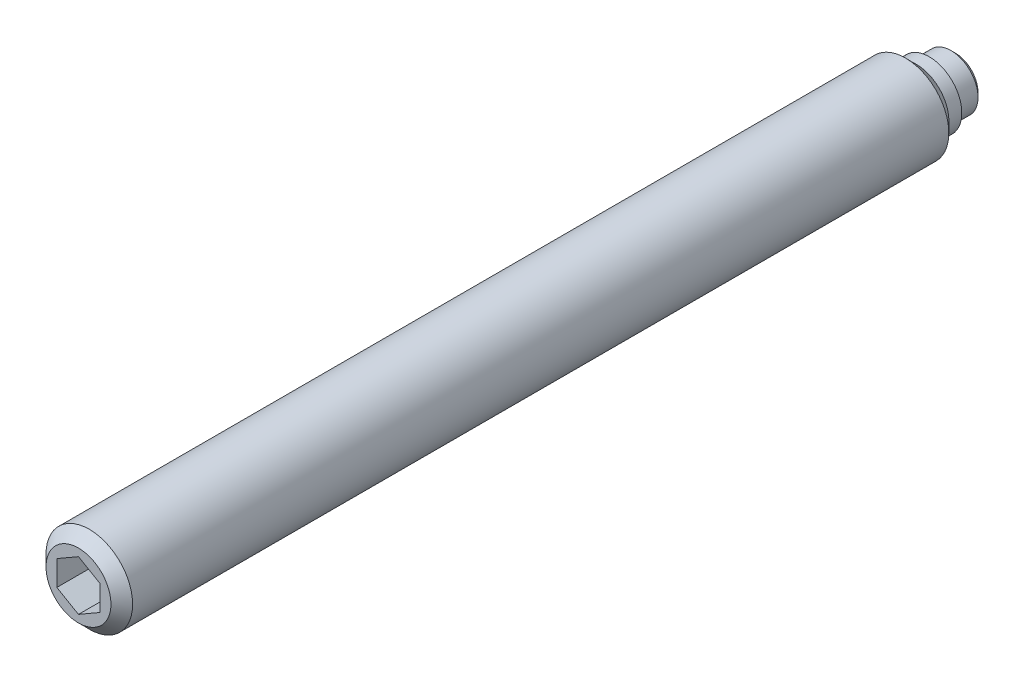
ISO-10303-21;
HEADER;
FILE_DESCRIPTION(('STEP AP214'),'2;1');
FILE_NAME('part.step','',(''),(''),'','','');
FILE_SCHEMA(('AUTOMOTIVE_DESIGN { 1 0 10303 214 1 1 1 1 }'));
ENDSEC;
DATA;
#1=APPLICATION_CONTEXT('core data for automotive mechanical design processes');
#2=APPLICATION_PROTOCOL_DEFINITION('international standard','automotive_design',2000,#1);
#3=PRODUCT_CONTEXT('',#1,'mechanical');
#4=PRODUCT('Part','Part','',(#3));
#5=PRODUCT_RELATED_PRODUCT_CATEGORY('part','',(#4));
#6=PRODUCT_DEFINITION_FORMATION('','',#4);
#7=PRODUCT_DEFINITION_CONTEXT('part definition',#1,'design');
#8=PRODUCT_DEFINITION('design','',#6,#7);
#9=PRODUCT_DEFINITION_SHAPE('','',#8);
#10=(LENGTH_UNIT() NAMED_UNIT(*) SI_UNIT(.MILLI.,.METRE.));
#11=(NAMED_UNIT(*) PLANE_ANGLE_UNIT() SI_UNIT($,.RADIAN.));
#12=(NAMED_UNIT(*) SI_UNIT($,.STERADIAN.) SOLID_ANGLE_UNIT());
#13=UNCERTAINTY_MEASURE_WITH_UNIT(LENGTH_MEASURE(1.E-05),#10,'distance_accuracy_value','');
#14=(GEOMETRIC_REPRESENTATION_CONTEXT(3) GLOBAL_UNCERTAINTY_ASSIGNED_CONTEXT((#13)) GLOBAL_UNIT_ASSIGNED_CONTEXT((#10,
#11,#12)) REPRESENTATION_CONTEXT('',''));
#15=CARTESIAN_POINT('',(0.,0.,0.));
#16=DIRECTION('',(0.,0.,1.));
#17=DIRECTION('',(1.,0.,0.));
#18=AXIS2_PLACEMENT_3D('',#15,#16,#17);
#19=CARTESIAN_POINT('',(0.,0.,1.2));
#20=DIRECTION('',(0.,0.,-1.));
#21=DIRECTION('',(-1.,0.,0.));
#22=AXIS2_PLACEMENT_3D('',#19,#20,#21);
#23=CYLINDRICAL_SURFACE('',#22,2.);
#24=CARTESIAN_POINT('',(0.,0.,2.3));
#25=DIRECTION('',(0.,0.,-1.));
#26=DIRECTION('',(-1.,0.,0.));
#27=AXIS2_PLACEMENT_3D('',#24,#25,#26);
#28=CIRCLE('',#27,2.);
#29=CARTESIAN_POINT('',(-2.,0.,2.3));
#30=VERTEX_POINT('',#29);
#31=EDGE_CURVE('E9',#30,#30,#28,.T.);
#32=ORIENTED_EDGE('',*,*,#31,.F.);
#33=EDGE_LOOP('',(#32));
#34=FACE_BOUND('',#33,.T.);
#35=CARTESIAN_POINT('',(0.,0.,40.));
#36=DIRECTION('',(0.,0.,1.));
#37=DIRECTION('',(1.,0.,0.));
#38=AXIS2_PLACEMENT_3D('',#35,#36,#37);
#39=CIRCLE('',#38,2.);
#40=CARTESIAN_POINT('',(2.,0.,40.));
#41=VERTEX_POINT('',#40);
#42=EDGE_CURVE('E115',#41,#41,#39,.T.);
#43=ORIENTED_EDGE('',*,*,#42,.F.);
#44=EDGE_LOOP('',(#43));
#45=FACE_BOUND('',#44,.T.);
#46=ADVANCED_FACE('F14',(#34,#45),#23,.T.);
#47=CARTESIAN_POINT('',(0.,0.,2.3));
#48=DIRECTION('',(0.,0.,1.));
#49=DIRECTION('',(1.,0.,0.));
#50=AXIS2_PLACEMENT_3D('',#47,#48,#49);
#51=CONICAL_SURFACE('',#50,2.,0.785398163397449);
#52=ORIENTED_EDGE('',*,*,#31,.T.);
#53=EDGE_LOOP('',(#52));
#54=FACE_BOUND('',#53,.T.);
#55=CARTESIAN_POINT('',(0.,0.,1.8));
#56=DIRECTION('',(0.,0.,-1.));
#57=DIRECTION('',(-1.,0.,0.));
#58=AXIS2_PLACEMENT_3D('',#55,#56,#57);
#59=CIRCLE('',#58,1.5);
#60=CARTESIAN_POINT('',(-1.5,0.,1.8));
#61=VERTEX_POINT('',#60);
#62=EDGE_CURVE('E21',#61,#61,#59,.T.);
#63=ORIENTED_EDGE('',*,*,#62,.F.);
#64=EDGE_LOOP('',(#63));
#65=FACE_BOUND('',#64,.T.);
#66=ADVANCED_FACE('F142',(#54,#65),#51,.T.);
#67=CARTESIAN_POINT('',(0.,0.,1.2));
#68=DIRECTION('',(0.,0.,-1.));
#69=DIRECTION('',(-1.,0.,0.));
#70=AXIS2_PLACEMENT_3D('',#67,#68,#69);
#71=CYLINDRICAL_SURFACE('',#70,1.5);
#72=CARTESIAN_POINT('',(0.,0.,1.2));
#73=DIRECTION('',(0.,0.,-1.));
#74=DIRECTION('',(-1.,0.,0.));
#75=AXIS2_PLACEMENT_3D('',#72,#73,#74);
#76=CIRCLE('',#75,1.5);
#77=CARTESIAN_POINT('',(-1.5,0.,1.2));
#78=VERTEX_POINT('',#77);
#79=EDGE_CURVE('E135',#78,#78,#76,.T.);
#80=ORIENTED_EDGE('',*,*,#79,.F.);
#81=EDGE_LOOP('',(#80));
#82=FACE_BOUND('',#81,.T.);
#83=ORIENTED_EDGE('',*,*,#62,.T.);
#84=EDGE_LOOP('',(#83));
#85=FACE_BOUND('',#84,.T.);
#86=ADVANCED_FACE('F140',(#82,#85),#71,.T.);
#87=CARTESIAN_POINT('',(0.,1.5,1.2));
#88=DIRECTION('',(0.,0.,1.));
#89=DIRECTION('',(1.,0.,0.));
#90=AXIS2_PLACEMENT_3D('',#87,#88,#89);
#91=PLANE('',#90);
#92=CARTESIAN_POINT('',(0.,0.,1.2));
#93=DIRECTION('',(0.,0.,-1.));
#94=DIRECTION('',(-1.,0.,0.));
#95=AXIS2_PLACEMENT_3D('',#92,#93,#94);
#96=CIRCLE('',#95,1.25);
#97=CARTESIAN_POINT('',(-1.25,0.,1.2));
#98=VERTEX_POINT('',#97);
#99=EDGE_CURVE('E132',#98,#98,#96,.T.);
#100=ORIENTED_EDGE('',*,*,#99,.F.);
#101=EDGE_LOOP('',(#100));
#102=FACE_BOUND('',#101,.T.);
#103=ORIENTED_EDGE('',*,*,#79,.T.);
#104=EDGE_LOOP('',(#103));
#105=FACE_BOUND('',#104,.T.);
#106=ADVANCED_FACE('F150',(#102,#105),#91,.F.);
#107=CARTESIAN_POINT('',(0.,0.,0.));
#108=DIRECTION('',(0.,0.,-1.));
#109=DIRECTION('',(-1.,0.,0.));
#110=AXIS2_PLACEMENT_3D('',#107,#108,#109);
#111=CYLINDRICAL_SURFACE('',#110,1.25);
#112=CARTESIAN_POINT('',(0.,0.,0.2));
#113=DIRECTION('',(0.,0.,-1.));
#114=DIRECTION('',(-1.,0.,0.));
#115=AXIS2_PLACEMENT_3D('',#112,#113,#114);
#116=CIRCLE('',#115,1.25);
#117=CARTESIAN_POINT('',(-1.25,0.,0.2));
#118=VERTEX_POINT('',#117);
#119=EDGE_CURVE('E129',#118,#118,#116,.T.);
#120=ORIENTED_EDGE('',*,*,#119,.F.);
#121=EDGE_LOOP('',(#120));
#122=FACE_BOUND('',#121,.T.);
#123=ORIENTED_EDGE('',*,*,#99,.T.);
#124=EDGE_LOOP('',(#123));
#125=FACE_BOUND('',#124,.T.);
#126=ADVANCED_FACE('F157',(#122,#125),#111,.T.);
#127=CARTESIAN_POINT('',(0.,0.,0.2));
#128=DIRECTION('',(0.,0.,1.));
#129=DIRECTION('',(1.,0.,0.));
#130=AXIS2_PLACEMENT_3D('',#127,#128,#129);
#131=CONICAL_SURFACE('',#130,1.25,0.785398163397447);
#132=CARTESIAN_POINT('',(0.,0.,0.));
#133=DIRECTION('',(0.,0.,-1.));
#134=DIRECTION('',(-1.,0.,0.));
#135=AXIS2_PLACEMENT_3D('',#132,#133,#134);
#136=CIRCLE('',#135,1.05);
#137=CARTESIAN_POINT('',(-1.05,0.,0.));
#138=VERTEX_POINT('',#137);
#139=EDGE_CURVE('E126',#138,#138,#136,.T.);
#140=ORIENTED_EDGE('',*,*,#139,.F.);
#141=EDGE_LOOP('',(#140));
#142=FACE_BOUND('',#141,.T.);
#143=ORIENTED_EDGE('',*,*,#119,.T.);
#144=EDGE_LOOP('',(#143));
#145=FACE_BOUND('',#144,.T.);
#146=ADVANCED_FACE('F161',(#142,#145),#131,.T.);
#147=CARTESIAN_POINT('',(0.,1.05,0.));
#148=DIRECTION('',(0.,0.,1.));
#149=DIRECTION('',(1.,0.,0.));
#150=AXIS2_PLACEMENT_3D('',#147,#148,#149);
#151=PLANE('',#150);
#152=ORIENTED_EDGE('',*,*,#139,.T.);
#153=EDGE_LOOP('',(#152));
#154=FACE_BOUND('',#153,.T.);
#155=ADVANCED_FACE('F165',(#154),#151,.F.);
#156=CARTESIAN_POINT('',(0.,0.,40.5));
#157=DIRECTION('',(0.,0.,1.));
#158=DIRECTION('',(1.,0.,0.));
#159=AXIS2_PLACEMENT_3D('',#156,#157,#158);
#160=PLANE('',#159);
#161=DIRECTION('',(0.866025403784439,-0.5,0.));
#162=VECTOR('',#161,1.);
#163=CARTESIAN_POINT('',(-1.,-0.577350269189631,40.5));
#164=LINE('',#163,#162);
#165=CARTESIAN_POINT('',(-1.,-0.577350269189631,40.5));
#166=VERTEX_POINT('',#165);
#167=CARTESIAN_POINT('',(0.,-1.15470053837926,40.5));
#168=VERTEX_POINT('',#167);
#169=EDGE_CURVE('E28',#166,#168,#164,.T.);
#170=ORIENTED_EDGE('',*,*,#169,.F.);
#171=DIRECTION('',(0.,-1.,0.));
#172=VECTOR('',#171,1.);
#173=CARTESIAN_POINT('',(-1.,0.577350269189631,40.5));
#174=LINE('',#173,#172);
#175=CARTESIAN_POINT('',(-1.,0.577350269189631,40.5));
#176=VERTEX_POINT('',#175);
#177=EDGE_CURVE('E111',#176,#166,#174,.T.);
#178=ORIENTED_EDGE('',*,*,#177,.F.);
#179=DIRECTION('',(-0.866025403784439,-0.5,0.));
#180=VECTOR('',#179,1.);
#181=CARTESIAN_POINT('',(0.,1.15470053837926,40.5));
#182=LINE('',#181,#180);
#183=CARTESIAN_POINT('',(0.,1.15470053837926,40.5));
#184=VERTEX_POINT('',#183);
#185=EDGE_CURVE('E109',#184,#176,#182,.T.);
#186=ORIENTED_EDGE('',*,*,#185,.F.);
#187=DIRECTION('',(-0.866025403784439,0.5,0.));
#188=VECTOR('',#187,1.);
#189=CARTESIAN_POINT('',(1.,0.577350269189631,40.5));
#190=LINE('',#189,#188);
#191=CARTESIAN_POINT('',(1.,0.577350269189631,40.5));
#192=VERTEX_POINT('',#191);
#193=EDGE_CURVE('E76',#192,#184,#190,.T.);
#194=ORIENTED_EDGE('',*,*,#193,.F.);
#195=DIRECTION('',(0.,1.,0.));
#196=VECTOR('',#195,1.);
#197=CARTESIAN_POINT('',(1.,-0.577350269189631,40.5));
#198=LINE('',#197,#196);
#199=CARTESIAN_POINT('',(1.,-0.577350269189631,40.5));
#200=VERTEX_POINT('',#199);
#201=EDGE_CURVE('E105',#200,#192,#198,.T.);
#202=ORIENTED_EDGE('',*,*,#201,.F.);
#203=DIRECTION('',(0.866025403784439,0.5,0.));
#204=VECTOR('',#203,1.);
#205=CARTESIAN_POINT('',(0.,-1.15470053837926,40.5));
#206=LINE('',#205,#204);
#207=EDGE_CURVE('E102',#168,#200,#206,.T.);
#208=ORIENTED_EDGE('',*,*,#207,.F.);
#209=EDGE_LOOP('',(#170,#178,#186,#194,#202,#208));
#210=FACE_BOUND('',#209,.T.);
#211=CARTESIAN_POINT('',(0.,0.,40.5));
#212=DIRECTION('',(0.,0.,1.));
#213=DIRECTION('',(1.,0.,0.));
#214=AXIS2_PLACEMENT_3D('',#211,#212,#213);
#215=CIRCLE('',#214,1.5);
#216=CARTESIAN_POINT('',(1.5,0.,40.5));
#217=VERTEX_POINT('',#216);
#218=EDGE_CURVE('E123',#217,#217,#215,.T.);
#219=ORIENTED_EDGE('',*,*,#218,.T.);
#220=EDGE_LOOP('',(#219));
#221=FACE_BOUND('',#220,.T.);
#222=ADVANCED_FACE('F169',(#210,#221),#160,.T.);
#223=CARTESIAN_POINT('',(0.,0.,40.5));
#224=DIRECTION('',(0.,0.,-1.));
#225=DIRECTION('',(-1.,0.,0.));
#226=AXIS2_PLACEMENT_3D('',#223,#224,#225);
#227=CONICAL_SURFACE('',#226,1.5,0.785398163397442);
#228=ORIENTED_EDGE('',*,*,#42,.T.);
#229=EDGE_LOOP('',(#228));
#230=FACE_BOUND('',#229,.T.);
#231=ORIENTED_EDGE('',*,*,#218,.F.);
#232=EDGE_LOOP('',(#231));
#233=FACE_BOUND('',#232,.T.);
#234=ADVANCED_FACE('F173',(#230,#233),#227,.T.);
#235=CARTESIAN_POINT('',(-1.,-0.577350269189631,38.));
#236=DIRECTION('',(-0.5,-0.866025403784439,0.));
#237=DIRECTION('',(0.866025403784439,-0.5,0.));
#238=AXIS2_PLACEMENT_3D('',#235,#236,#237);
#239=PLANE('',#238);
#240=ORIENTED_EDGE('',*,*,#169,.T.);
#241=DIRECTION('',(0.,0.,1.));
#242=VECTOR('',#241,1.);
#243=CARTESIAN_POINT('',(0.,-1.15470053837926,38.));
#244=LINE('',#243,#242);
#245=CARTESIAN_POINT('',(0.,-1.15470053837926,38.));
#246=VERTEX_POINT('',#245);
#247=EDGE_CURVE('E58',#246,#168,#244,.T.);
#248=ORIENTED_EDGE('',*,*,#247,.F.);
#249=DIRECTION('',(0.866025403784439,-0.5,0.));
#250=VECTOR('',#249,1.);
#251=CARTESIAN_POINT('',(-1.,-0.577350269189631,38.));
#252=LINE('',#251,#250);
#253=CARTESIAN_POINT('',(-1.,-0.577350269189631,38.));
#254=VERTEX_POINT('',#253);
#255=EDGE_CURVE('E113',#254,#246,#252,.T.);
#256=ORIENTED_EDGE('',*,*,#255,.F.);
#257=DIRECTION('',(0.,0.,1.));
#258=VECTOR('',#257,1.);
#259=CARTESIAN_POINT('',(-1.,-0.577350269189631,38.));
#260=LINE('',#259,#258);
#261=EDGE_CURVE('E36',#254,#166,#260,.T.);
#262=ORIENTED_EDGE('',*,*,#261,.T.);
#263=EDGE_LOOP('',(#240,#248,#256,#262));
#264=FACE_BOUND('',#263,.T.);
#265=ADVANCED_FACE('F177',(#264),#239,.F.);
#266=CARTESIAN_POINT('',(-1.,0.577350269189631,38.));
#267=DIRECTION('',(-1.,0.,0.));
#268=DIRECTION('',(0.,0.,1.));
#269=AXIS2_PLACEMENT_3D('',#266,#267,#268);
#270=PLANE('',#269);
#271=ORIENTED_EDGE('',*,*,#177,.T.);
#272=ORIENTED_EDGE('',*,*,#261,.F.);
#273=DIRECTION('',(0.,-1.,0.));
#274=VECTOR('',#273,1.);
#275=CARTESIAN_POINT('',(-1.,0.577350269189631,38.));
#276=LINE('',#275,#274);
#277=CARTESIAN_POINT('',(-1.,0.577350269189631,38.));
#278=VERTEX_POINT('',#277);
#279=EDGE_CURVE('E88',#278,#254,#276,.T.);
#280=ORIENTED_EDGE('',*,*,#279,.F.);
#281=DIRECTION('',(0.,0.,1.));
#282=VECTOR('',#281,1.);
#283=CARTESIAN_POINT('',(-1.,0.577350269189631,38.));
#284=LINE('',#283,#282);
#285=EDGE_CURVE('E80',#278,#176,#284,.T.);
#286=ORIENTED_EDGE('',*,*,#285,.T.);
#287=EDGE_LOOP('',(#271,#272,#280,#286));
#288=FACE_BOUND('',#287,.T.);
#289=ADVANCED_FACE('F181',(#288),#270,.F.);
#290=CARTESIAN_POINT('',(0.,1.15470053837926,38.));
#291=DIRECTION('',(-0.5,0.866025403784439,0.));
#292=DIRECTION('',(-0.866025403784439,-0.5,0.));
#293=AXIS2_PLACEMENT_3D('',#290,#291,#292);
#294=PLANE('',#293);
#295=ORIENTED_EDGE('',*,*,#185,.T.);
#296=ORIENTED_EDGE('',*,*,#285,.F.);
#297=DIRECTION('',(-0.866025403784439,-0.5,0.));
#298=VECTOR('',#297,1.);
#299=CARTESIAN_POINT('',(0.,1.15470053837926,38.));
#300=LINE('',#299,#298);
#301=CARTESIAN_POINT('',(0.,1.15470053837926,38.));
#302=VERTEX_POINT('',#301);
#303=EDGE_CURVE('E84',#302,#278,#300,.T.);
#304=ORIENTED_EDGE('',*,*,#303,.F.);
#305=DIRECTION('',(0.,0.,1.));
#306=VECTOR('',#305,1.);
#307=CARTESIAN_POINT('',(0.,1.15470053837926,38.));
#308=LINE('',#307,#306);
#309=EDGE_CURVE('E69',#302,#184,#308,.T.);
#310=ORIENTED_EDGE('',*,*,#309,.T.);
#311=EDGE_LOOP('',(#295,#296,#304,#310));
#312=FACE_BOUND('',#311,.T.);
#313=ADVANCED_FACE('F85',(#312),#294,.F.);
#314=CARTESIAN_POINT('',(1.,0.577350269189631,38.));
#315=DIRECTION('',(0.5,0.866025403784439,0.));
#316=DIRECTION('',(-0.866025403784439,0.5,0.));
#317=AXIS2_PLACEMENT_3D('',#314,#315,#316);
#318=PLANE('',#317);
#319=ORIENTED_EDGE('',*,*,#193,.T.);
#320=ORIENTED_EDGE('',*,*,#309,.F.);
#321=DIRECTION('',(-0.866025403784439,0.5,0.));
#322=VECTOR('',#321,1.);
#323=CARTESIAN_POINT('',(1.,0.577350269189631,38.));
#324=LINE('',#323,#322);
#325=CARTESIAN_POINT('',(1.,0.577350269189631,38.));
#326=VERTEX_POINT('',#325);
#327=EDGE_CURVE('E73',#326,#302,#324,.T.);
#328=ORIENTED_EDGE('',*,*,#327,.F.);
#329=DIRECTION('',(0.,0.,1.));
#330=VECTOR('',#329,1.);
#331=CARTESIAN_POINT('',(1.,0.577350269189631,38.));
#332=LINE('',#331,#330);
#333=EDGE_CURVE('E81',#326,#192,#332,.T.);
#334=ORIENTED_EDGE('',*,*,#333,.T.);
#335=EDGE_LOOP('',(#319,#320,#328,#334));
#336=FACE_BOUND('',#335,.T.);
#337=ADVANCED_FACE('F71',(#336),#318,.F.);
#338=CARTESIAN_POINT('',(1.,-0.577350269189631,38.));
#339=DIRECTION('',(1.,0.,0.));
#340=DIRECTION('',(0.,0.,-1.));
#341=AXIS2_PLACEMENT_3D('',#338,#339,#340);
#342=PLANE('',#341);
#343=ORIENTED_EDGE('',*,*,#201,.T.);
#344=ORIENTED_EDGE('',*,*,#333,.F.);
#345=DIRECTION('',(0.,1.,0.));
#346=VECTOR('',#345,1.);
#347=CARTESIAN_POINT('',(1.,-0.577350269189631,38.));
#348=LINE('',#347,#346);
#349=CARTESIAN_POINT('',(1.,-0.577350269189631,38.));
#350=VERTEX_POINT('',#349);
#351=EDGE_CURVE('E94',#350,#326,#348,.T.);
#352=ORIENTED_EDGE('',*,*,#351,.F.);
#353=DIRECTION('',(0.,0.,1.));
#354=VECTOR('',#353,1.);
#355=CARTESIAN_POINT('',(1.,-0.577350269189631,38.));
#356=LINE('',#355,#354);
#357=EDGE_CURVE('E118',#350,#200,#356,.T.);
#358=ORIENTED_EDGE('',*,*,#357,.T.);
#359=EDGE_LOOP('',(#343,#344,#352,#358));
#360=FACE_BOUND('',#359,.T.);
#361=ADVANCED_FACE('F185',(#360),#342,.F.);
#362=CARTESIAN_POINT('',(0.,-1.15470053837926,38.));
#363=DIRECTION('',(0.5,-0.866025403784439,0.));
#364=DIRECTION('',(0.866025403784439,0.5,0.));
#365=AXIS2_PLACEMENT_3D('',#362,#363,#364);
#366=PLANE('',#365);
#367=ORIENTED_EDGE('',*,*,#207,.T.);
#368=ORIENTED_EDGE('',*,*,#357,.F.);
#369=DIRECTION('',(0.866025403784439,0.5,0.));
#370=VECTOR('',#369,1.);
#371=CARTESIAN_POINT('',(0.,-1.15470053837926,38.));
#372=LINE('',#371,#370);
#373=EDGE_CURVE('E96',#246,#350,#372,.T.);
#374=ORIENTED_EDGE('',*,*,#373,.F.);
#375=ORIENTED_EDGE('',*,*,#247,.T.);
#376=EDGE_LOOP('',(#367,#368,#374,#375));
#377=FACE_BOUND('',#376,.T.);
#378=ADVANCED_FACE('F182',(#377),#366,.F.);
#379=CARTESIAN_POINT('',(0.,0.,38.));
#380=DIRECTION('',(0.,0.,1.));
#381=DIRECTION('',(1.,0.,0.));
#382=AXIS2_PLACEMENT_3D('',#379,#380,#381);
#383=PLANE('',#382);
#384=ORIENTED_EDGE('',*,*,#255,.T.);
#385=ORIENTED_EDGE('',*,*,#373,.T.);
#386=ORIENTED_EDGE('',*,*,#351,.T.);
#387=ORIENTED_EDGE('',*,*,#327,.T.);
#388=ORIENTED_EDGE('',*,*,#303,.T.);
#389=ORIENTED_EDGE('',*,*,#279,.T.);
#390=EDGE_LOOP('',(#384,#385,#386,#387,#388,#389));
#391=FACE_BOUND('',#390,.T.);
#392=ADVANCED_FACE('F91',(#391),#383,.T.);
#393=CLOSED_SHELL('',(#46,#66,#86,#106,#126,#146,#155,#222,#234,#265,#289,#313,#337,#361,#378,#392));
#394=MANIFOLD_SOLID_BREP('B1',#393);
#395=ADVANCED_BREP_SHAPE_REPRESENTATION('',(#18,#394),#14);
#396=SHAPE_DEFINITION_REPRESENTATION(#9,#395);
ENDSEC;
END-ISO-10303-21;
